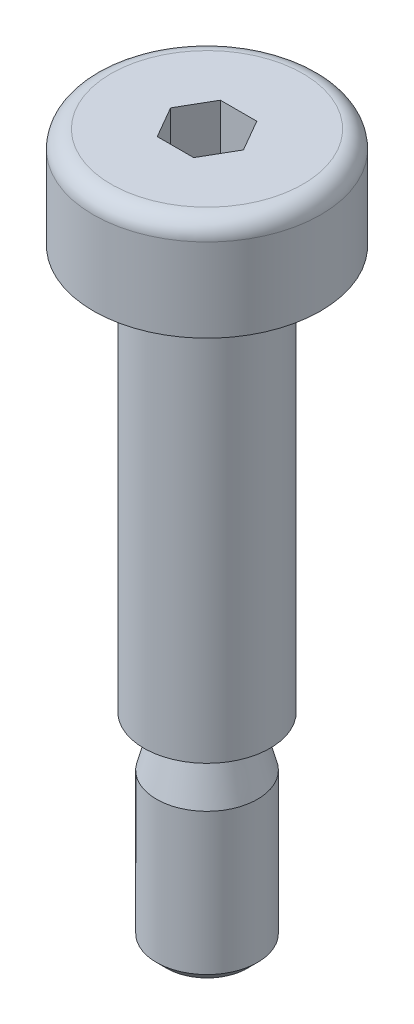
from build123d import *

# Parameters (mm, degrees)
SCHNITT_LINEAR_AUSTRAGEN1_DEPTH = 2


with BuildPart() as part:
    # Skizze1 → Rotation1 (revolve)
    with BuildSketch(Plane.XY):
        with BuildLine():
            Line((0, 0), (-1.6, 0))
            Line((-1.6, 0), (-2, 0.4))
            Line((-2, 0.4), (-2, 6))
            Line((-2, 6), (-1.6, 7.492820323))
            Line((-1.6, 7.492820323), (-1.6, 8))
            Line((-1.6, 8), (-2.5, 8))
            Line((-2.5, 8), (-2.5, 24))
            Line((-2.5, 24), (-4.5, 24))
            Line((-4.5, 24), (-4.5, 27.3))
            ThreePointArc((-4.5, 27.3), (-4.294974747, 27.794974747), (-3.8, 28))
            Line((-3.8, 28), (0, 28))
            Line((0, 28), (0, 0))
        make_face()
    revolve(axis=Axis((0, 28, 0), (0, -1, 0)))

    # Skizze2 → Schnitt-Linear austragen1 (cut)
    with BuildSketch(Plane(origin=(0, 28, 0), x_dir=(1, 0, 0), z_dir=(0, 1, 0))):
        Polygon((0.721687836, 1.25), (-0.721687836, 1.25), (-1.443375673, 0), (-0.721687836, -1.25), (0.721687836, -1.25), (1.443375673, 0), align=None)
    extrude(amount=-SCHNITT_LINEAR_AUSTRAGEN1_DEPTH, mode=Mode.SUBTRACT)


solid = part.part
